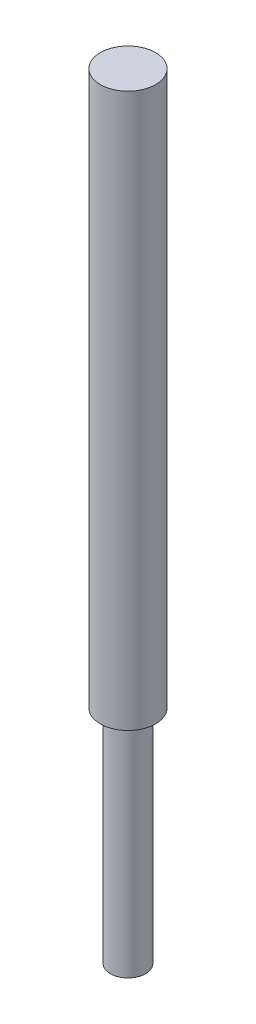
ISO-10303-21;
HEADER;
FILE_DESCRIPTION(('STEP AP214'),'2;1');
FILE_NAME('part.step','',(''),(''),'','','');
FILE_SCHEMA(('AUTOMOTIVE_DESIGN { 1 0 10303 214 1 1 1 1 }'));
ENDSEC;
DATA;
#1=APPLICATION_CONTEXT('core data for automotive mechanical design processes');
#2=APPLICATION_PROTOCOL_DEFINITION('international standard','automotive_design',2000,#1);
#3=PRODUCT_CONTEXT('',#1,'mechanical');
#4=PRODUCT('Part','Part','',(#3));
#5=PRODUCT_RELATED_PRODUCT_CATEGORY('part','',(#4));
#6=PRODUCT_DEFINITION_FORMATION('','',#4);
#7=PRODUCT_DEFINITION_CONTEXT('part definition',#1,'design');
#8=PRODUCT_DEFINITION('design','',#6,#7);
#9=PRODUCT_DEFINITION_SHAPE('','',#8);
#10=(LENGTH_UNIT() NAMED_UNIT(*) SI_UNIT(.MILLI.,.METRE.));
#11=(NAMED_UNIT(*) PLANE_ANGLE_UNIT() SI_UNIT($,.RADIAN.));
#12=(NAMED_UNIT(*) SI_UNIT($,.STERADIAN.) SOLID_ANGLE_UNIT());
#13=UNCERTAINTY_MEASURE_WITH_UNIT(LENGTH_MEASURE(1.E-05),#10,'distance_accuracy_value','');
#14=(GEOMETRIC_REPRESENTATION_CONTEXT(3) GLOBAL_UNCERTAINTY_ASSIGNED_CONTEXT((#13)) GLOBAL_UNIT_ASSIGNED_CONTEXT((#10,
#11,#12)) REPRESENTATION_CONTEXT('',''));
#15=CARTESIAN_POINT('',(0.,0.,0.));
#16=DIRECTION('',(0.,0.,1.));
#17=DIRECTION('',(1.,0.,0.));
#18=AXIS2_PLACEMENT_3D('',#15,#16,#17);
#19=CARTESIAN_POINT('',(0.,80.,0.));
#20=DIRECTION('',(0.,-1.,0.));
#21=DIRECTION('',(0.,0.,-1.));
#22=AXIS2_PLACEMENT_3D('',#19,#20,#21);
#23=CYLINDRICAL_SURFACE('',#22,6.35);
#24=CARTESIAN_POINT('',(0.,80.,0.));
#25=DIRECTION('',(0.,1.,0.));
#26=DIRECTION('',(0.,0.,1.));
#27=AXIS2_PLACEMENT_3D('',#24,#25,#26);
#28=CIRCLE('',#27,6.35);
#29=CARTESIAN_POINT('',(0.,80.,6.35));
#30=VERTEX_POINT('',#29);
#31=EDGE_CURVE('E10',#30,#30,#28,.T.);
#32=ORIENTED_EDGE('',*,*,#31,.F.);
#33=EDGE_LOOP('',(#32));
#34=FACE_BOUND('',#33,.T.);
#35=CARTESIAN_POINT('',(0.,0.,0.));
#36=DIRECTION('',(0.,1.,0.));
#37=DIRECTION('',(0.,0.,1.));
#38=AXIS2_PLACEMENT_3D('',#35,#36,#37);
#39=CIRCLE('',#38,6.35);
#40=CARTESIAN_POINT('',(0.,0.,6.35));
#41=VERTEX_POINT('',#40);
#42=EDGE_CURVE('E41',#41,#41,#39,.T.);
#43=ORIENTED_EDGE('',*,*,#42,.T.);
#44=EDGE_LOOP('',(#43));
#45=FACE_BOUND('',#44,.T.);
#46=ADVANCED_FACE('F38',(#34,#45),#23,.T.);
#47=CARTESIAN_POINT('',(0.,0.,0.));
#48=DIRECTION('',(0.,1.,0.));
#49=DIRECTION('',(0.,0.,1.));
#50=AXIS2_PLACEMENT_3D('',#47,#48,#49);
#51=PLANE('',#50);
#52=ORIENTED_EDGE('',*,*,#42,.F.);
#53=EDGE_LOOP('',(#52));
#54=FACE_BOUND('',#53,.T.);
#55=ADVANCED_FACE('F61',(#54),#51,.F.);
#56=CARTESIAN_POINT('',(0.,280.,0.));
#57=DIRECTION('',(0.,-1.,0.));
#58=DIRECTION('',(0.,0.,-1.));
#59=AXIS2_PLACEMENT_3D('',#56,#57,#58);
#60=CYLINDRICAL_SURFACE('',#59,10.);
#61=CARTESIAN_POINT('',(0.,280.,0.));
#62=DIRECTION('',(0.,1.,0.));
#63=DIRECTION('',(0.,0.,1.));
#64=AXIS2_PLACEMENT_3D('',#61,#62,#63);
#65=CIRCLE('',#64,10.);
#66=CARTESIAN_POINT('',(0.,280.,10.));
#67=VERTEX_POINT('',#66);
#68=EDGE_CURVE('E48',#67,#67,#65,.T.);
#69=ORIENTED_EDGE('',*,*,#68,.F.);
#70=EDGE_LOOP('',(#69));
#71=FACE_BOUND('',#70,.T.);
#72=CARTESIAN_POINT('',(0.,80.,0.));
#73=DIRECTION('',(0.,1.,0.));
#74=DIRECTION('',(0.,0.,1.));
#75=AXIS2_PLACEMENT_3D('',#72,#73,#74);
#76=CIRCLE('',#75,10.);
#77=CARTESIAN_POINT('',(0.,80.,10.));
#78=VERTEX_POINT('',#77);
#79=EDGE_CURVE('E50',#78,#78,#76,.T.);
#80=ORIENTED_EDGE('',*,*,#79,.T.);
#81=EDGE_LOOP('',(#80));
#82=FACE_BOUND('',#81,.T.);
#83=ADVANCED_FACE('F58',(#71,#82),#60,.T.);
#84=CARTESIAN_POINT('',(0.,280.,0.));
#85=DIRECTION('',(0.,1.,0.));
#86=DIRECTION('',(0.,0.,1.));
#87=AXIS2_PLACEMENT_3D('',#84,#85,#86);
#88=PLANE('',#87);
#89=ORIENTED_EDGE('',*,*,#68,.T.);
#90=EDGE_LOOP('',(#89));
#91=FACE_BOUND('',#90,.T.);
#92=ADVANCED_FACE('F56',(#91),#88,.T.);
#93=CARTESIAN_POINT('',(0.,80.,0.));
#94=DIRECTION('',(0.,1.,0.));
#95=DIRECTION('',(0.,0.,1.));
#96=AXIS2_PLACEMENT_3D('',#93,#94,#95);
#97=PLANE('',#96);
#98=ORIENTED_EDGE('',*,*,#31,.T.);
#99=EDGE_LOOP('',(#98));
#100=FACE_BOUND('',#99,.T.);
#101=ORIENTED_EDGE('',*,*,#79,.F.);
#102=EDGE_LOOP('',(#101));
#103=FACE_BOUND('',#102,.T.);
#104=ADVANCED_FACE('F65',(#100,#103),#97,.F.);
#105=CLOSED_SHELL('',(#46,#55,#83,#92,#104));
#106=MANIFOLD_SOLID_BREP('B2',#105);
#107=ADVANCED_BREP_SHAPE_REPRESENTATION('',(#18,#106),#14);
#108=SHAPE_DEFINITION_REPRESENTATION(#9,#107);
ENDSEC;
END-ISO-10303-21;
